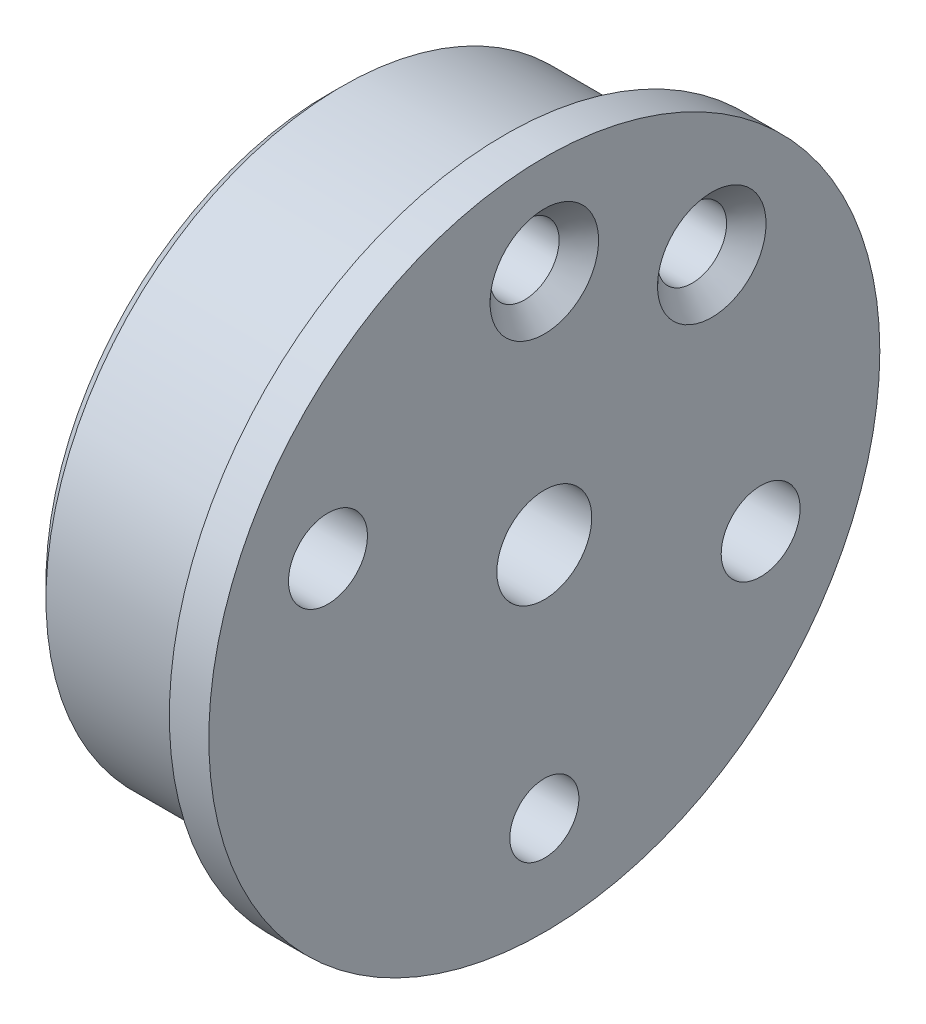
ISO-10303-21;
HEADER;
FILE_DESCRIPTION(('STEP AP214'),'2;1');
FILE_NAME('part.step','',(''),(''),'','','');
FILE_SCHEMA(('AUTOMOTIVE_DESIGN { 1 0 10303 214 1 1 1 1 }'));
ENDSEC;
DATA;
#1=APPLICATION_CONTEXT('core data for automotive mechanical design processes');
#2=APPLICATION_PROTOCOL_DEFINITION('international standard','automotive_design',2000,#1);
#3=PRODUCT_CONTEXT('',#1,'mechanical');
#4=PRODUCT('Part','Part','',(#3));
#5=PRODUCT_RELATED_PRODUCT_CATEGORY('part','',(#4));
#6=PRODUCT_DEFINITION_FORMATION('','',#4);
#7=PRODUCT_DEFINITION_CONTEXT('part definition',#1,'design');
#8=PRODUCT_DEFINITION('design','',#6,#7);
#9=PRODUCT_DEFINITION_SHAPE('','',#8);
#10=(LENGTH_UNIT() NAMED_UNIT(*) SI_UNIT(.MILLI.,.METRE.));
#11=(NAMED_UNIT(*) PLANE_ANGLE_UNIT() SI_UNIT($,.RADIAN.));
#12=(NAMED_UNIT(*) SI_UNIT($,.STERADIAN.) SOLID_ANGLE_UNIT());
#13=UNCERTAINTY_MEASURE_WITH_UNIT(LENGTH_MEASURE(1.E-05),#10,'distance_accuracy_value','');
#14=(GEOMETRIC_REPRESENTATION_CONTEXT(3) GLOBAL_UNCERTAINTY_ASSIGNED_CONTEXT((#13)) GLOBAL_UNIT_ASSIGNED_CONTEXT((#10,
#11,#12)) REPRESENTATION_CONTEXT('',''));
#15=CARTESIAN_POINT('',(0.,0.,0.));
#16=DIRECTION('',(0.,0.,1.));
#17=DIRECTION('',(1.,0.,0.));
#18=AXIS2_PLACEMENT_3D('',#15,#16,#17);
#19=CARTESIAN_POINT('',(0.,0.,0.));
#20=DIRECTION('',(1.,0.,0.));
#21=DIRECTION('',(0.,0.,-1.));
#22=AXIS2_PLACEMENT_3D('',#19,#20,#21);
#23=PLANE('',#22);
#24=CARTESIAN_POINT('',(0.,16.970562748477,-16.9705627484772));
#25=DIRECTION('',(1.,0.,0.));
#26=DIRECTION('',(0.,0.,-1.));
#27=AXIS2_PLACEMENT_3D('',#24,#25,#26);
#28=CIRCLE('',#27,5.49999999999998);
#29=CARTESIAN_POINT('',(0.,16.970562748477,-22.4705627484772));
#30=VERTEX_POINT('',#29);
#31=EDGE_CURVE('E43',#30,#30,#28,.F.);
#32=ORIENTED_EDGE('',*,*,#31,.T.);
#33=EDGE_LOOP('',(#32));
#34=FACE_BOUND('',#33,.T.);
#35=CARTESIAN_POINT('',(0.,24.,0.));
#36=DIRECTION('',(1.,0.,0.));
#37=DIRECTION('',(0.,0.,-1.));
#38=AXIS2_PLACEMENT_3D('',#35,#36,#37);
#39=CIRCLE('',#38,5.49999999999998);
#40=CARTESIAN_POINT('',(0.,24.,-5.49999999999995));
#41=VERTEX_POINT('',#40);
#42=EDGE_CURVE('E47',#41,#41,#39,.F.);
#43=ORIENTED_EDGE('',*,*,#42,.T.);
#44=EDGE_LOOP('',(#43));
#45=FACE_BOUND('',#44,.T.);
#46=CARTESIAN_POINT('',(0.,-24.,0.));
#47=DIRECTION('',(-1.,0.,0.));
#48=DIRECTION('',(0.,0.,1.));
#49=AXIS2_PLACEMENT_3D('',#46,#47,#48);
#50=CIRCLE('',#49,3.5);
#51=CARTESIAN_POINT('',(0.,-24.,3.50000000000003));
#52=VERTEX_POINT('',#51);
#53=EDGE_CURVE('E91',#52,#52,#50,.T.);
#54=ORIENTED_EDGE('',*,*,#53,.T.);
#55=EDGE_LOOP('',(#54));
#56=FACE_BOUND('',#55,.T.);
#57=CARTESIAN_POINT('',(0.,-9.76167943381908,-21.9250909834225));
#58=DIRECTION('',(-1.,0.,0.));
#59=DIRECTION('',(0.,0.,1.));
#60=AXIS2_PLACEMENT_3D('',#57,#58,#59);
#61=CIRCLE('',#60,4.);
#62=CARTESIAN_POINT('',(0.,-9.76167943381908,-17.9250909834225));
#63=VERTEX_POINT('',#62);
#64=EDGE_CURVE('E77',#63,#63,#61,.T.);
#65=ORIENTED_EDGE('',*,*,#64,.T.);
#66=EDGE_LOOP('',(#65));
#67=FACE_BOUND('',#66,.T.);
#68=CARTESIAN_POINT('',(0.,9.76167943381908,21.9250909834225));
#69=DIRECTION('',(-1.,0.,0.));
#70=DIRECTION('',(0.,0.,1.));
#71=AXIS2_PLACEMENT_3D('',#68,#69,#70);
#72=CIRCLE('',#71,4.);
#73=CARTESIAN_POINT('',(0.,9.76167943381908,25.9250909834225));
#74=VERTEX_POINT('',#73);
#75=EDGE_CURVE('E71',#74,#74,#72,.T.);
#76=ORIENTED_EDGE('',*,*,#75,.T.);
#77=EDGE_LOOP('',(#76));
#78=FACE_BOUND('',#77,.T.);
#79=CARTESIAN_POINT('',(0.,0.,0.));
#80=DIRECTION('',(-1.,0.,0.));
#81=DIRECTION('',(0.,0.,1.));
#82=AXIS2_PLACEMENT_3D('',#79,#80,#81);
#83=CIRCLE('',#82,4.80788719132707);
#84=CARTESIAN_POINT('',(0.,0.,4.80788719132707));
#85=VERTEX_POINT('',#84);
#86=EDGE_CURVE('E67',#85,#85,#83,.T.);
#87=ORIENTED_EDGE('',*,*,#86,.T.);
#88=EDGE_LOOP('',(#87));
#89=FACE_BOUND('',#88,.T.);
#90=CARTESIAN_POINT('',(0.,0.,0.));
#91=DIRECTION('',(1.,0.,0.));
#92=DIRECTION('',(0.,0.,-1.));
#93=AXIS2_PLACEMENT_3D('',#90,#91,#92);
#94=CIRCLE('',#93,34.);
#95=CARTESIAN_POINT('',(0.,0.,-34.));
#96=VERTEX_POINT('',#95);
#97=EDGE_CURVE('E52',#96,#96,#94,.T.);
#98=ORIENTED_EDGE('',*,*,#97,.T.);
#99=EDGE_LOOP('',(#98));
#100=FACE_BOUND('',#99,.T.);
#101=ADVANCED_FACE('F32',(#34,#45,#56,#67,#78,#89,#100),#23,.T.);
#102=CARTESIAN_POINT('',(21.5860239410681,0.,0.));
#103=DIRECTION('',(1.,0.,0.));
#104=DIRECTION('',(0.,0.,-1.));
#105=AXIS2_PLACEMENT_3D('',#102,#103,#104);
#106=CYLINDRICAL_SURFACE('',#105,34.);
#107=CARTESIAN_POINT('',(-4.,0.,0.));
#108=DIRECTION('',(1.,0.,0.));
#109=DIRECTION('',(0.,0.,-1.));
#110=AXIS2_PLACEMENT_3D('',#107,#108,#109);
#111=CIRCLE('',#110,34.);
#112=CARTESIAN_POINT('',(-4.,0.,-34.));
#113=VERTEX_POINT('',#112);
#114=EDGE_CURVE('E55',#113,#113,#111,.T.);
#115=ORIENTED_EDGE('',*,*,#114,.T.);
#116=EDGE_LOOP('',(#115));
#117=FACE_BOUND('',#116,.T.);
#118=ORIENTED_EDGE('',*,*,#97,.F.);
#119=EDGE_LOOP('',(#118));
#120=FACE_BOUND('',#119,.T.);
#121=ADVANCED_FACE('F140',(#117,#120),#106,.T.);
#122=CARTESIAN_POINT('',(-4.,-34.,-2.37420731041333E-13));
#123=DIRECTION('',(-1.,0.,0.));
#124=DIRECTION('',(0.,0.,1.));
#125=AXIS2_PLACEMENT_3D('',#122,#123,#124);
#126=PLANE('',#125);
#127=CARTESIAN_POINT('',(-4.,0.,0.));
#128=DIRECTION('',(1.,0.,0.));
#129=DIRECTION('',(0.,0.,-1.));
#130=AXIS2_PLACEMENT_3D('',#127,#128,#129);
#131=CIRCLE('',#130,30.);
#132=CARTESIAN_POINT('',(-4.,0.,-30.));
#133=VERTEX_POINT('',#132);
#134=EDGE_CURVE('E58',#133,#133,#131,.T.);
#135=ORIENTED_EDGE('',*,*,#134,.T.);
#136=EDGE_LOOP('',(#135));
#137=FACE_BOUND('',#136,.T.);
#138=ORIENTED_EDGE('',*,*,#114,.F.);
#139=EDGE_LOOP('',(#138));
#140=FACE_BOUND('',#139,.T.);
#141=ADVANCED_FACE('F134',(#137,#140),#126,.T.);
#142=CARTESIAN_POINT('',(21.5860239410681,0.,0.));
#143=DIRECTION('',(1.,0.,0.));
#144=DIRECTION('',(0.,0.,-1.));
#145=AXIS2_PLACEMENT_3D('',#142,#143,#144);
#146=CYLINDRICAL_SURFACE('',#145,30.);
#147=CARTESIAN_POINT('',(-20.5,0.,0.));
#148=DIRECTION('',(1.,0.,0.));
#149=DIRECTION('',(0.,0.,-1.));
#150=AXIS2_PLACEMENT_3D('',#147,#148,#149);
#151=CIRCLE('',#150,30.);
#152=CARTESIAN_POINT('',(-20.5,0.,-30.));
#153=VERTEX_POINT('',#152);
#154=EDGE_CURVE('E61',#153,#153,#151,.T.);
#155=ORIENTED_EDGE('',*,*,#154,.T.);
#156=EDGE_LOOP('',(#155));
#157=FACE_BOUND('',#156,.T.);
#158=ORIENTED_EDGE('',*,*,#134,.F.);
#159=EDGE_LOOP('',(#158));
#160=FACE_BOUND('',#159,.T.);
#161=ADVANCED_FACE('F128',(#157,#160),#146,.T.);
#162=CARTESIAN_POINT('',(-20.5,0.,0.));
#163=DIRECTION('',(1.,0.,0.));
#164=DIRECTION('',(0.,0.,-1.));
#165=AXIS2_PLACEMENT_3D('',#162,#163,#164);
#166=CONICAL_SURFACE('',#165,30.,0.785398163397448);
#167=CARTESIAN_POINT('',(-22.,0.,0.));
#168=DIRECTION('',(1.,0.,0.));
#169=DIRECTION('',(0.,0.,-1.));
#170=AXIS2_PLACEMENT_3D('',#167,#168,#169);
#171=CIRCLE('',#170,28.5);
#172=CARTESIAN_POINT('',(-22.,0.,-28.5));
#173=VERTEX_POINT('',#172);
#174=EDGE_CURVE('E64',#173,#173,#171,.T.);
#175=ORIENTED_EDGE('',*,*,#174,.T.);
#176=EDGE_LOOP('',(#175));
#177=FACE_BOUND('',#176,.T.);
#178=ORIENTED_EDGE('',*,*,#154,.F.);
#179=EDGE_LOOP('',(#178));
#180=FACE_BOUND('',#179,.T.);
#181=ADVANCED_FACE('F112',(#177,#180),#166,.T.);
#182=CARTESIAN_POINT('',(-22.,-28.5,-1.99014436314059E-13));
#183=DIRECTION('',(-1.,0.,0.));
#184=DIRECTION('',(0.,0.,1.));
#185=AXIS2_PLACEMENT_3D('',#182,#183,#184);
#186=PLANE('',#185);
#187=CARTESIAN_POINT('',(-22.,-24.,0.));
#188=DIRECTION('',(-1.,0.,0.));
#189=DIRECTION('',(0.,0.,1.));
#190=AXIS2_PLACEMENT_3D('',#187,#188,#189);
#191=CIRCLE('',#190,3.5);
#192=CARTESIAN_POINT('',(-22.,-24.,3.50000000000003));
#193=VERTEX_POINT('',#192);
#194=EDGE_CURVE('E92',#193,#193,#191,.T.);
#195=ORIENTED_EDGE('',*,*,#194,.F.);
#196=EDGE_LOOP('',(#195));
#197=FACE_BOUND('',#196,.T.);
#198=CARTESIAN_POINT('',(-22.,16.970562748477,-16.9705627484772));
#199=DIRECTION('',(-1.,0.,0.));
#200=DIRECTION('',(0.,0.,1.));
#201=AXIS2_PLACEMENT_3D('',#198,#199,#200);
#202=CIRCLE('',#201,3.5);
#203=CARTESIAN_POINT('',(-22.,16.970562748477,-13.4705627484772));
#204=VERTEX_POINT('',#203);
#205=EDGE_CURVE('E88',#204,#204,#202,.T.);
#206=ORIENTED_EDGE('',*,*,#205,.F.);
#207=EDGE_LOOP('',(#206));
#208=FACE_BOUND('',#207,.T.);
#209=CARTESIAN_POINT('',(-22.,24.,0.));
#210=DIRECTION('',(-1.,0.,0.));
#211=DIRECTION('',(0.,0.,1.));
#212=AXIS2_PLACEMENT_3D('',#209,#210,#211);
#213=CIRCLE('',#212,3.5);
#214=CARTESIAN_POINT('',(-22.,24.,3.50000000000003));
#215=VERTEX_POINT('',#214);
#216=EDGE_CURVE('E83',#215,#215,#213,.T.);
#217=ORIENTED_EDGE('',*,*,#216,.F.);
#218=EDGE_LOOP('',(#217));
#219=FACE_BOUND('',#218,.T.);
#220=CARTESIAN_POINT('',(-22.,-9.76167943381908,-21.9250909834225));
#221=DIRECTION('',(-1.,0.,0.));
#222=DIRECTION('',(0.,0.,1.));
#223=AXIS2_PLACEMENT_3D('',#220,#221,#222);
#224=CIRCLE('',#223,4.);
#225=CARTESIAN_POINT('',(-22.,-9.76167943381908,-17.9250909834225));
#226=VERTEX_POINT('',#225);
#227=EDGE_CURVE('E80',#226,#226,#224,.T.);
#228=ORIENTED_EDGE('',*,*,#227,.F.);
#229=EDGE_LOOP('',(#228));
#230=FACE_BOUND('',#229,.T.);
#231=CARTESIAN_POINT('',(-22.,9.76167943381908,21.9250909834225));
#232=DIRECTION('',(-1.,0.,0.));
#233=DIRECTION('',(0.,0.,1.));
#234=AXIS2_PLACEMENT_3D('',#231,#232,#233);
#235=CIRCLE('',#234,4.);
#236=CARTESIAN_POINT('',(-22.,9.76167943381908,25.9250909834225));
#237=VERTEX_POINT('',#236);
#238=EDGE_CURVE('E74',#237,#237,#235,.T.);
#239=ORIENTED_EDGE('',*,*,#238,.F.);
#240=EDGE_LOOP('',(#239));
#241=FACE_BOUND('',#240,.T.);
#242=CARTESIAN_POINT('',(-22.,0.,0.));
#243=DIRECTION('',(-1.,0.,0.));
#244=DIRECTION('',(0.,0.,1.));
#245=AXIS2_PLACEMENT_3D('',#242,#243,#244);
#246=CIRCLE('',#245,4.80788719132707);
#247=CARTESIAN_POINT('',(-22.,0.,4.80788719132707));
#248=VERTEX_POINT('',#247);
#249=EDGE_CURVE('E68',#248,#248,#246,.T.);
#250=ORIENTED_EDGE('',*,*,#249,.F.);
#251=EDGE_LOOP('',(#250));
#252=FACE_BOUND('',#251,.T.);
#253=ORIENTED_EDGE('',*,*,#174,.F.);
#254=EDGE_LOOP('',(#253));
#255=FACE_BOUND('',#254,.T.);
#256=ADVANCED_FACE('F108',(#197,#208,#219,#230,#241,#252,#255),#186,.T.);
#257=CARTESIAN_POINT('',(0.,0.,0.));
#258=DIRECTION('',(-1.,0.,0.));
#259=DIRECTION('',(0.,0.,1.));
#260=AXIS2_PLACEMENT_3D('',#257,#258,#259);
#261=CYLINDRICAL_SURFACE('',#260,4.80788719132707);
#262=ORIENTED_EDGE('',*,*,#86,.F.);
#263=EDGE_LOOP('',(#262));
#264=FACE_BOUND('',#263,.T.);
#265=ORIENTED_EDGE('',*,*,#249,.T.);
#266=EDGE_LOOP('',(#265));
#267=FACE_BOUND('',#266,.T.);
#268=ADVANCED_FACE('F111',(#264,#267),#261,.F.);
#269=CARTESIAN_POINT('',(0.,9.76167943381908,21.9250909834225));
#270=DIRECTION('',(-1.,0.,0.));
#271=DIRECTION('',(0.,0.,1.));
#272=AXIS2_PLACEMENT_3D('',#269,#270,#271);
#273=CYLINDRICAL_SURFACE('',#272,4.);
#274=ORIENTED_EDGE('',*,*,#75,.F.);
#275=EDGE_LOOP('',(#274));
#276=FACE_BOUND('',#275,.T.);
#277=ORIENTED_EDGE('',*,*,#238,.T.);
#278=EDGE_LOOP('',(#277));
#279=FACE_BOUND('',#278,.T.);
#280=ADVANCED_FACE('F209',(#276,#279),#273,.F.);
#281=CARTESIAN_POINT('',(0.,-9.76167943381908,-21.9250909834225));
#282=DIRECTION('',(-1.,0.,0.));
#283=DIRECTION('',(0.,0.,1.));
#284=AXIS2_PLACEMENT_3D('',#281,#282,#283);
#285=CYLINDRICAL_SURFACE('',#284,4.);
#286=ORIENTED_EDGE('',*,*,#64,.F.);
#287=EDGE_LOOP('',(#286));
#288=FACE_BOUND('',#287,.T.);
#289=ORIENTED_EDGE('',*,*,#227,.T.);
#290=EDGE_LOOP('',(#289));
#291=FACE_BOUND('',#290,.T.);
#292=ADVANCED_FACE('F189',(#288,#291),#285,.F.);
#293=CARTESIAN_POINT('',(0.,24.,0.));
#294=DIRECTION('',(-1.,0.,0.));
#295=DIRECTION('',(0.,0.,1.));
#296=AXIS2_PLACEMENT_3D('',#293,#294,#295);
#297=CYLINDRICAL_SURFACE('',#296,3.5);
#298=CARTESIAN_POINT('',(-1.99999999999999,24.,0.));
#299=DIRECTION('',(1.,0.,0.));
#300=DIRECTION('',(0.,0.,-1.));
#301=AXIS2_PLACEMENT_3D('',#298,#299,#300);
#302=CIRCLE('',#301,3.5);
#303=CARTESIAN_POINT('',(-1.99999999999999,24.,-3.49999999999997));
#304=VERTEX_POINT('',#303);
#305=EDGE_CURVE('E10',#304,#304,#302,.T.);
#306=ORIENTED_EDGE('',*,*,#305,.T.);
#307=EDGE_LOOP('',(#306));
#308=FACE_BOUND('',#307,.T.);
#309=ORIENTED_EDGE('',*,*,#216,.T.);
#310=EDGE_LOOP('',(#309));
#311=FACE_BOUND('',#310,.T.);
#312=ADVANCED_FACE('F181',(#308,#311),#297,.F.);
#313=CARTESIAN_POINT('',(0.,16.970562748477,-16.9705627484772));
#314=DIRECTION('',(-1.,0.,0.));
#315=DIRECTION('',(0.,0.,1.));
#316=AXIS2_PLACEMENT_3D('',#313,#314,#315);
#317=CYLINDRICAL_SURFACE('',#316,3.5);
#318=CARTESIAN_POINT('',(-1.99999999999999,16.970562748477,-16.9705627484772));
#319=DIRECTION('',(1.,0.,0.));
#320=DIRECTION('',(0.,0.,-1.));
#321=AXIS2_PLACEMENT_3D('',#318,#319,#320);
#322=CIRCLE('',#321,3.5);
#323=CARTESIAN_POINT('',(-1.99999999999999,16.970562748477,-20.4705627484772));
#324=VERTEX_POINT('',#323);
#325=EDGE_CURVE('E39',#324,#324,#322,.T.);
#326=ORIENTED_EDGE('',*,*,#325,.T.);
#327=EDGE_LOOP('',(#326));
#328=FACE_BOUND('',#327,.T.);
#329=ORIENTED_EDGE('',*,*,#205,.T.);
#330=EDGE_LOOP('',(#329));
#331=FACE_BOUND('',#330,.T.);
#332=ADVANCED_FACE('F104',(#328,#331),#317,.F.);
#333=CARTESIAN_POINT('',(0.,-24.,0.));
#334=DIRECTION('',(-1.,0.,0.));
#335=DIRECTION('',(0.,0.,1.));
#336=AXIS2_PLACEMENT_3D('',#333,#334,#335);
#337=CYLINDRICAL_SURFACE('',#336,3.5);
#338=ORIENTED_EDGE('',*,*,#53,.F.);
#339=EDGE_LOOP('',(#338));
#340=FACE_BOUND('',#339,.T.);
#341=ORIENTED_EDGE('',*,*,#194,.T.);
#342=EDGE_LOOP('',(#341));
#343=FACE_BOUND('',#342,.T.);
#344=ADVANCED_FACE('F100',(#340,#343),#337,.F.);
#345=CARTESIAN_POINT('',(0.,16.970562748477,-16.9705627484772));
#346=DIRECTION('',(1.,0.,0.));
#347=DIRECTION('',(0.,0.,-1.));
#348=AXIS2_PLACEMENT_3D('',#345,#346,#347);
#349=CONICAL_SURFACE('',#348,5.49999999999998,0.785398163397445);
#350=ORIENTED_EDGE('',*,*,#325,.F.);
#351=EDGE_LOOP('',(#350));
#352=FACE_BOUND('',#351,.T.);
#353=ORIENTED_EDGE('',*,*,#31,.F.);
#354=EDGE_LOOP('',(#353));
#355=FACE_BOUND('',#354,.T.);
#356=ADVANCED_FACE('F103',(#352,#355),#349,.F.);
#357=CARTESIAN_POINT('',(0.,24.,0.));
#358=DIRECTION('',(1.,0.,0.));
#359=DIRECTION('',(0.,0.,-1.));
#360=AXIS2_PLACEMENT_3D('',#357,#358,#359);
#361=CONICAL_SURFACE('',#360,5.49999999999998,0.785398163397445);
#362=ORIENTED_EDGE('',*,*,#305,.F.);
#363=EDGE_LOOP('',(#362));
#364=FACE_BOUND('',#363,.T.);
#365=ORIENTED_EDGE('',*,*,#42,.F.);
#366=EDGE_LOOP('',(#365));
#367=FACE_BOUND('',#366,.T.);
#368=ADVANCED_FACE('F34',(#364,#367),#361,.F.);
#369=CLOSED_SHELL('',(#101,#121,#141,#161,#181,#256,#268,#280,#292,#312,#332,#344,#356,#368));
#370=MANIFOLD_SOLID_BREP('B2',#369);
#371=ADVANCED_BREP_SHAPE_REPRESENTATION('',(#18,#370),#14);
#372=SHAPE_DEFINITION_REPRESENTATION(#9,#371);
ENDSEC;
END-ISO-10303-21;
